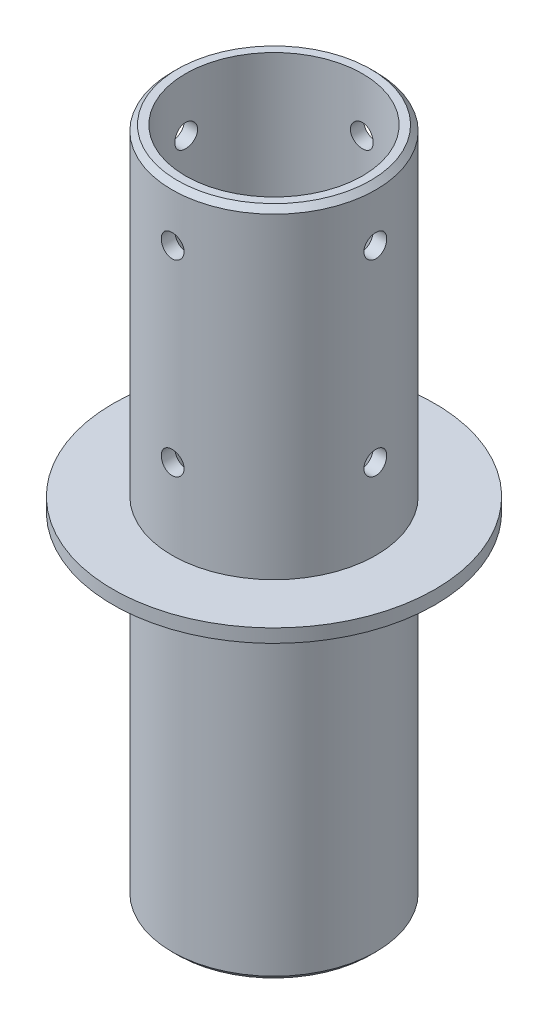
from build123d import *

# Parameters (mm, degrees)
ESQUISSE1_W                            = 5
ESQUISSE1_H                            = 250
ESQUISSE3_W                            = 4.25
ESQUISSE3_H                            = 38.001
TROU_TARAUD_M101_AT_2_COUNT            = 2
TROU_TARAUD_M101_AT_2_PITCH            = 70
R_P_TITION_CIRCULAIRE1_COUNT           = 4
R_P_TITION_CIRCULAIRE1_COPY_1_SKETCH_W = 4.25
R_P_TITION_CIRCULAIRE1_COPY_1_SKETCH_H = 38.001
R_P_TITION_CIRCULAIRE1_COPY_2_SKETCH_W = 4.25
R_P_TITION_CIRCULAIRE1_COPY_2_SKETCH_H = 38.001
R_P_TITION_CIRCULAIRE1_COPY_3_SKETCH_W = 4.25
R_P_TITION_CIRCULAIRE1_COPY_3_SKETCH_H = 38.001
CHANFREIN1_SIZE                        = 2
ESQUISSE5_W                            = 22
ESQUISSE5_H                            = 5


with BuildPart() as part:
    # Esquisse1 → tube (revolve)
    with BuildSketch(Plane.XY, mode=Mode.PRIVATE) as tube_sk:
        with Locations((35.5, 125)):
            Rectangle(ESQUISSE1_W, ESQUISSE1_H)
    revolve(tube_sk.sketch.rotate(Axis((0, 3115.539934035, 0), (0, -1, 0)), 180), axis=Axis((0, 3115.539934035, 0), (0, -1, 0)))

    # Esquisse3 → Trou taraud_ M101 (revolve, cut)
    with BuildSketch(Plane(origin=(0, 230, 0), x_dir=(0, 1, 0), z_dir=(1, 0, 0))):
        with Locations((2.125, 19.0005)):
            Rectangle(ESQUISSE3_W, ESQUISSE3_H)
    trou_taraud_m101 = revolve(axis=Axis((0, 230, -6.35), (0, 0, 1)), mode=Mode.SUBTRACT)

    # Trou taraud_ M101 at 2: Trou taraud_ M101 ×2
    with Locations(*[(0, -i * TROU_TARAUD_M101_AT_2_PITCH, 0) for i in range(1, TROU_TARAUD_M101_AT_2_COUNT)]):
        add(trou_taraud_m101, mode=Mode.SUBTRACT)

    # R_p_tition circulaire1: Trou taraud_ M101 ×4 about axis
    r_p_tition_circulaire1_axis = Axis((0, 3115.539934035, 0), (0, 1, 0))
    for i in range(1, R_P_TITION_CIRCULAIRE1_COUNT):
        add(trou_taraud_m101.rotate(r_p_tition_circulaire1_axis, i * 360 / R_P_TITION_CIRCULAIRE1_COUNT), mode=Mode.SUBTRACT)

    # R_p_tition circulaire1 copy 1 sketch → R_p_tition circulaire1 copy 1 (revolve, cut)
    with BuildSketch(Plane(origin=(0, 160, 0), x_dir=(0, 1, 0), z_dir=(0, 0, -1))):
        with Locations((2.125, 19.0005)):
            Rectangle(R_P_TITION_CIRCULAIRE1_COPY_1_SKETCH_W, R_P_TITION_CIRCULAIRE1_COPY_1_SKETCH_H)
    revolve(axis=Axis((-6.35, 160, 0), (1, 0, 0)), mode=Mode.SUBTRACT)

    # R_p_tition circulaire1 copy 2 sketch → R_p_tition circulaire1 copy 2 (revolve, cut)
    with BuildSketch(Plane(origin=(0, 160, 0), x_dir=(0, 1, 0), z_dir=(-1, 0, 0))):
        with Locations((2.125, 19.0005)):
            Rectangle(R_P_TITION_CIRCULAIRE1_COPY_2_SKETCH_W, R_P_TITION_CIRCULAIRE1_COPY_2_SKETCH_H)
    revolve(axis=Axis((0, 160, 6.35), (0, 0, -1)), mode=Mode.SUBTRACT)

    # R_p_tition circulaire1 copy 3 sketch → R_p_tition circulaire1 copy 3 (revolve, cut)
    with BuildSketch(Plane(origin=(0, 160, 0), x_dir=(0, 1, 0), z_dir=(0, 0, 1))):
        with Locations((2.125, 19.0005)):
            Rectangle(R_P_TITION_CIRCULAIRE1_COPY_3_SKETCH_W, R_P_TITION_CIRCULAIRE1_COPY_3_SKETCH_H)
    revolve(axis=Axis((6.35, 160, 0), (-1, 0, 0)), mode=Mode.SUBTRACT)

    # Chanfrein1
    chanfrein1_edges = [part.edges().sort_by_distance(p)[0] for p in [
        (38, 0, 0),
        (38, 250, 0),
    ]]
    chamfer(chanfrein1_edges, length=CHANFREIN1_SIZE)

    # Esquisse5 → Collerette (revolve)
    with BuildSketch(Plane.XY, mode=Mode.PRIVATE) as collerette_sk:
        with Locations((-49, 127.5)):
            Rectangle(ESQUISSE5_W, ESQUISSE5_H)
    revolve(collerette_sk.sketch.rotate(Axis((0, 3115.539934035, 0), (0, 1, 0)), 180), axis=Axis((0, 3115.539934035, 0), (0, 1, 0)))


solid = part.part
